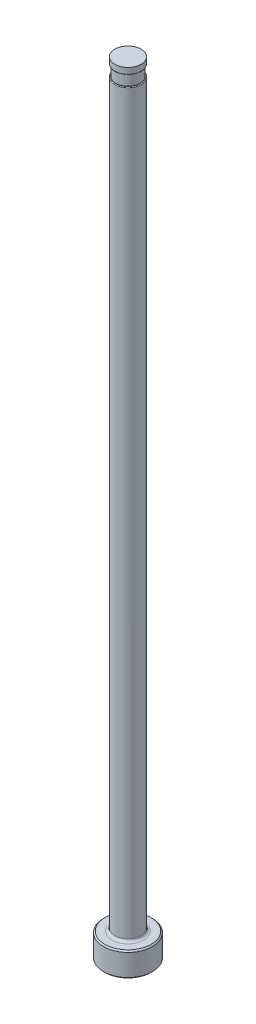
ISO-10303-21;
HEADER;
FILE_DESCRIPTION(('STEP AP214'),'2;1');
FILE_NAME('part.step','',(''),(''),'','','');
FILE_SCHEMA(('AUTOMOTIVE_DESIGN { 1 0 10303 214 1 1 1 1 }'));
ENDSEC;
DATA;
#1=APPLICATION_CONTEXT('core data for automotive mechanical design processes');
#2=APPLICATION_PROTOCOL_DEFINITION('international standard','automotive_design',2000,#1);
#3=PRODUCT_CONTEXT('',#1,'mechanical');
#4=PRODUCT('Part','Part','',(#3));
#5=PRODUCT_RELATED_PRODUCT_CATEGORY('part','',(#4));
#6=PRODUCT_DEFINITION_FORMATION('','',#4);
#7=PRODUCT_DEFINITION_CONTEXT('part definition',#1,'design');
#8=PRODUCT_DEFINITION('design','',#6,#7);
#9=PRODUCT_DEFINITION_SHAPE('','',#8);
#10=(LENGTH_UNIT() NAMED_UNIT(*) SI_UNIT(.MILLI.,.METRE.));
#11=(NAMED_UNIT(*) PLANE_ANGLE_UNIT() SI_UNIT($,.RADIAN.));
#12=(NAMED_UNIT(*) SI_UNIT($,.STERADIAN.) SOLID_ANGLE_UNIT());
#13=UNCERTAINTY_MEASURE_WITH_UNIT(LENGTH_MEASURE(1.E-05),#10,'distance_accuracy_value','');
#14=(GEOMETRIC_REPRESENTATION_CONTEXT(3) GLOBAL_UNCERTAINTY_ASSIGNED_CONTEXT((#13)) GLOBAL_UNIT_ASSIGNED_CONTEXT((#10,
#11,#12)) REPRESENTATION_CONTEXT('',''));
#15=CARTESIAN_POINT('',(0.,0.,0.));
#16=DIRECTION('',(0.,0.,1.));
#17=DIRECTION('',(1.,0.,0.));
#18=AXIS2_PLACEMENT_3D('',#15,#16,#17);
#19=CARTESIAN_POINT('',(-2.57936999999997,151.13,0.));
#20=DIRECTION('',(0.,1.,0.));
#21=DIRECTION('',(0.,0.,1.));
#22=AXIS2_PLACEMENT_3D('',#19,#20,#21);
#23=PLANE('',#22);
#24=CARTESIAN_POINT('',(0.,151.13,0.));
#25=DIRECTION('',(0.,1.,0.));
#26=DIRECTION('',(0.,0.,1.));
#27=AXIS2_PLACEMENT_3D('',#24,#25,#26);
#28=CIRCLE('',#27,2.43331999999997);
#29=CARTESIAN_POINT('',(0.,151.13,2.43331999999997));
#30=VERTEX_POINT('',#29);
#31=EDGE_CURVE('E11',#30,#30,#28,.F.);
#32=ORIENTED_EDGE('',*,*,#31,.T.);
#33=EDGE_LOOP('',(#32));
#34=FACE_BOUND('',#33,.T.);
#35=CARTESIAN_POINT('',(0.,151.13,0.));
#36=DIRECTION('',(0.,1.,0.));
#37=DIRECTION('',(0.,0.,1.));
#38=AXIS2_PLACEMENT_3D('',#35,#36,#37);
#39=CIRCLE('',#38,2.37616999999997);
#40=CARTESIAN_POINT('',(0.,151.13,2.37616999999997));
#41=VERTEX_POINT('',#40);
#42=EDGE_CURVE('E78',#41,#41,#39,.T.);
#43=ORIENTED_EDGE('',*,*,#42,.T.);
#44=EDGE_LOOP('',(#43));
#45=FACE_BOUND('',#44,.T.);
#46=ADVANCED_FACE('F36',(#34,#45),#23,.F.);
#47=CARTESIAN_POINT('',(0.,259.958771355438,0.));
#48=DIRECTION('',(0.,1.,0.));
#49=DIRECTION('',(0.,0.,1.));
#50=AXIS2_PLACEMENT_3D('',#47,#48,#49);
#51=CYLINDRICAL_SURFACE('',#50,2.57936999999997);
#52=DIRECTION('',(0.,1.,0.));
#53=VECTOR('',#52,1.);
#54=CARTESIAN_POINT('',(-2.37616999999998,259.958771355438,-1.00347681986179));
#55=LINE('',#54,#53);
#56=CARTESIAN_POINT('',(-2.37616999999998,148.971,-1.00347681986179));
#57=VERTEX_POINT('',#56);
#58=CARTESIAN_POINT('',(-2.37616999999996,86.614,-1.00347681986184));
#59=VERTEX_POINT('',#58);
#60=EDGE_CURVE('E73',#57,#59,#55,.F.);
#61=ORIENTED_EDGE('',*,*,#60,.F.);
#62=CARTESIAN_POINT('',(0.,148.971,0.));
#63=DIRECTION('',(0.,-1.,0.));
#64=DIRECTION('',(0.,0.,-1.));
#65=AXIS2_PLACEMENT_3D('',#62,#63,#64);
#66=CIRCLE('',#65,2.57936999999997);
#67=CARTESIAN_POINT('',(-2.37616999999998,148.971,1.00347681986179));
#68=VERTEX_POINT('',#67);
#69=EDGE_CURVE('E51',#57,#68,#66,.T.);
#70=ORIENTED_EDGE('',*,*,#69,.T.);
#71=DIRECTION('',(0.,1.,0.));
#72=VECTOR('',#71,1.);
#73=CARTESIAN_POINT('',(-2.37616999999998,259.958771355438,1.00347681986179));
#74=LINE('',#73,#72);
#75=CARTESIAN_POINT('',(-2.37616999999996,86.614,1.00347681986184));
#76=VERTEX_POINT('',#75);
#77=EDGE_CURVE('E84',#76,#68,#74,.T.);
#78=ORIENTED_EDGE('',*,*,#77,.F.);
#79=CARTESIAN_POINT('',(-2.37616999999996,86.614,-1.00347681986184));
#80=CARTESIAN_POINT('',(-2.3761678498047,86.5806535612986,-1.00347324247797));
#81=CARTESIAN_POINT('',(-2.37669600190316,86.547321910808,-1.00223238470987));
#82=CARTESIAN_POINT('',(-2.37878830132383,86.4808712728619,-0.997259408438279));
#83=CARTESIAN_POINT('',(-2.3803526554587,86.4477523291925,-0.993526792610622));
#84=CARTESIAN_POINT('',(-2.38657174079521,86.348866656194,-0.97854537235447));
#85=CARTESIAN_POINT('',(-2.39275229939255,86.2837173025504,-0.963512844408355));
#86=CARTESIAN_POINT('',(-2.40858326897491,86.1569814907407,-0.923223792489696));
#87=CARTESIAN_POINT('',(-2.41823988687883,86.0954016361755,-0.897948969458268));
#88=CARTESIAN_POINT('',(-2.4399460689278,85.9780247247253,-0.837167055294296));
#89=CARTESIAN_POINT('',(-2.45199238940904,85.9222199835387,-0.801673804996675));
#90=CARTESIAN_POINT('',(-2.47634550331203,85.8211237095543,-0.722822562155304));
#91=CARTESIAN_POINT('',(-2.48860868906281,85.7754444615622,-0.679950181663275));
#92=CARTESIAN_POINT('',(-2.51236371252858,85.6930631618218,-0.586096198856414));
#93=CARTESIAN_POINT('',(-2.52385591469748,85.6563568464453,-0.53511846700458));
#94=CARTESIAN_POINT('',(-2.54336333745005,85.5968448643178,-0.432311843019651));
#95=CARTESIAN_POINT('',(-2.55161740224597,85.5729816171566,-0.381139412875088));
#96=CARTESIAN_POINT('',(-2.56521925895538,85.5345821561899,-0.275047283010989));
#97=CARTESIAN_POINT('',(-2.5705685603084,85.5200410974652,-0.220129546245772));
#98=CARTESIAN_POINT('',(-2.57742936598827,85.5015339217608,-0.112636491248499));
#99=CARTESIAN_POINT('',(-2.57920175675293,85.4968477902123,-0.0602005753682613));
#100=CARTESIAN_POINT('',(-2.57951508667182,85.496013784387,0.0447435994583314));
#101=CARTESIAN_POINT('',(-2.57805674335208,85.4998640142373,0.0972518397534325));
#102=CARTESIAN_POINT('',(-2.57214487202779,85.515773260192,0.199435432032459));
#103=CARTESIAN_POINT('',(-2.56776943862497,85.5276183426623,0.249148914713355));
#104=CARTESIAN_POINT('',(-2.55654798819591,85.5589461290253,0.345804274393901));
#105=CARTESIAN_POINT('',(-2.54970197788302,85.5784288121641,0.392746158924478));
#106=CARTESIAN_POINT('',(-2.53407309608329,85.62487953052,0.483513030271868));
#107=CARTESIAN_POINT('',(-2.52525719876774,85.6519775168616,0.527265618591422));
#108=CARTESIAN_POINT('',(-2.5066235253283,85.7126856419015,0.609736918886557));
#109=CARTESIAN_POINT('',(-2.49680555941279,85.7462970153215,0.648454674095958));
#110=CARTESIAN_POINT('',(-2.47647062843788,85.8212568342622,0.722358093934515));
#111=CARTESIAN_POINT('',(-2.46594700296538,85.8629479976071,0.757193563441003));
#112=CARTESIAN_POINT('',(-2.44575759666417,85.951357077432,0.820068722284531));
#113=CARTESIAN_POINT('',(-2.43609222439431,85.9980773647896,0.848105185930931));
#114=CARTESIAN_POINT('',(-2.41760539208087,86.0998831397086,0.899528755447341));
#115=CARTESIAN_POINT('',(-2.40894797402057,86.1553422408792,0.922233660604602));
#116=CARTESIAN_POINT('',(-2.39441308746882,86.269312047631,0.959340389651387));
#117=CARTESIAN_POINT('',(-2.3885356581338,86.3278227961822,0.973742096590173));
#118=CARTESIAN_POINT('',(-2.38160417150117,86.4245543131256,0.990534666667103));
#119=CARTESIAN_POINT('',(-2.37957064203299,86.4622987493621,0.995396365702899));
#120=CARTESIAN_POINT('',(-2.37685226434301,86.5380255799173,1.00186164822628));
#121=CARTESIAN_POINT('',(-2.3761642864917,86.5760072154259,1.00347279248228));
#122=CARTESIAN_POINT('',(-2.37616999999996,86.614,1.00347681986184));
#123=B_SPLINE_CURVE_WITH_KNOTS('',3,(#79,#80,#81,#82,#83,#84,#85,#86,#87,#88,#89,#90,#91,#92,
#93,#94,#95,#96,#97,#98,#99,#100,#101,#102,#103,#104,#105,#106,#107,#108,#109,#110,#111,#112,
#113,#114,#115,#116,#117,#118,#119,#120,#121,#122),.UNSPECIFIED.,.F.,.F.,(4,2,2,2,2,2,2,2,2,2,2,
2,2,2,2,2,2,2,2,2,2,4),(0.,0.099982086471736,0.199984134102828,0.400421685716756,
0.601218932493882,0.80174546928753,0.992181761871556,1.18252738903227,1.35280353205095,
1.52299110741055,1.68023815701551,1.83745028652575,1.99061412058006,2.14377753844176,
2.29973239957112,2.45571685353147,2.62103910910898,2.78643964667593,2.96734496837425,
3.14825283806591,3.26243374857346,3.37634876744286),.UNSPECIFIED.);
#124=EDGE_CURVE('E81',#59,#76,#123,.T.);
#125=ORIENTED_EDGE('',*,*,#124,.F.);
#126=EDGE_LOOP('',(#61,#70,#78,#125));
#127=FACE_BOUND('',#126,.T.);
#128=CARTESIAN_POINT('',(0.,5.25779999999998,0.));
#129=DIRECTION('',(0.,1.,0.));
#130=DIRECTION('',(0.,0.,1.));
#131=AXIS2_PLACEMENT_3D('',#128,#129,#130);
#132=CIRCLE('',#131,2.57936999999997);
#133=CARTESIAN_POINT('',(0.,5.25779999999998,2.57936999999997));
#134=VERTEX_POINT('',#133);
#135=EDGE_CURVE('E116',#134,#134,#132,.T.);
#136=ORIENTED_EDGE('',*,*,#135,.T.);
#137=EDGE_LOOP('',(#136));
#138=FACE_BOUND('',#137,.T.);
#139=ADVANCED_FACE('F82',(#127,#138),#51,.T.);
#140=CARTESIAN_POINT('',(0.,0.,0.));
#141=DIRECTION('',(0.,-1.,0.));
#142=DIRECTION('',(0.,0.,-1.));
#143=AXIS2_PLACEMENT_3D('',#140,#141,#142);
#144=PLANE('',#143);
#145=CARTESIAN_POINT('',(0.,0.,0.));
#146=DIRECTION('',(0.,-1.,0.));
#147=DIRECTION('',(0.,0.,-1.));
#148=AXIS2_PLACEMENT_3D('',#145,#146,#147);
#149=CIRCLE('',#148,4.50849999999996);
#150=CARTESIAN_POINT('',(0.,0.,-4.50849999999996));
#151=VERTEX_POINT('',#150);
#152=EDGE_CURVE('E113',#151,#151,#149,.T.);
#153=ORIENTED_EDGE('',*,*,#152,.T.);
#154=EDGE_LOOP('',(#153));
#155=FACE_BOUND('',#154,.T.);
#156=ADVANCED_FACE('F192',(#155),#144,.T.);
#157=CARTESIAN_POINT('',(0.,259.958771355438,0.));
#158=DIRECTION('',(0.,1.,0.));
#159=DIRECTION('',(0.,0.,1.));
#160=AXIS2_PLACEMENT_3D('',#157,#158,#159);
#161=CYLINDRICAL_SURFACE('',#160,4.76249999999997);
#162=CARTESIAN_POINT('',(0.,4.49579999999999,0.));
#163=DIRECTION('',(0.,1.,0.));
#164=DIRECTION('',(0.,0.,1.));
#165=AXIS2_PLACEMENT_3D('',#162,#163,#164);
#166=CIRCLE('',#165,4.76249999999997);
#167=CARTESIAN_POINT('',(0.,4.49579999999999,4.76249999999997));
#168=VERTEX_POINT('',#167);
#169=EDGE_CURVE('E110',#168,#168,#166,.F.);
#170=ORIENTED_EDGE('',*,*,#169,.T.);
#171=EDGE_LOOP('',(#170));
#172=FACE_BOUND('',#171,.T.);
#173=CARTESIAN_POINT('',(0.,0.254000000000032,0.));
#174=DIRECTION('',(0.,-1.,0.));
#175=DIRECTION('',(0.,0.,-1.));
#176=AXIS2_PLACEMENT_3D('',#173,#174,#175);
#177=CIRCLE('',#176,4.76249999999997);
#178=CARTESIAN_POINT('',(0.,0.254000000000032,-4.76249999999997));
#179=VERTEX_POINT('',#178);
#180=EDGE_CURVE('E107',#179,#179,#177,.F.);
#181=ORIENTED_EDGE('',*,*,#180,.T.);
#182=EDGE_LOOP('',(#181));
#183=FACE_BOUND('',#182,.T.);
#184=ADVANCED_FACE('F195',(#172,#183),#161,.T.);
#185=CARTESIAN_POINT('',(-4.76249999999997,4.7498,0.));
#186=DIRECTION('',(0.,1.,0.));
#187=DIRECTION('',(0.,0.,1.));
#188=AXIS2_PLACEMENT_3D('',#185,#186,#187);
#189=PLANE('',#188);
#190=CARTESIAN_POINT('',(0.,4.7498,0.));
#191=DIRECTION('',(0.,1.,0.));
#192=DIRECTION('',(0.,0.,1.));
#193=AXIS2_PLACEMENT_3D('',#190,#191,#192);
#194=CIRCLE('',#193,3.08736999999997);
#195=CARTESIAN_POINT('',(0.,4.7498,3.08736999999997));
#196=VERTEX_POINT('',#195);
#197=EDGE_CURVE('E87',#196,#196,#194,.F.);
#198=ORIENTED_EDGE('',*,*,#197,.T.);
#199=EDGE_LOOP('',(#198));
#200=FACE_BOUND('',#199,.T.);
#201=CARTESIAN_POINT('',(0.,4.7498,0.));
#202=DIRECTION('',(0.,1.,0.));
#203=DIRECTION('',(0.,0.,1.));
#204=AXIS2_PLACEMENT_3D('',#201,#202,#203);
#205=CIRCLE('',#204,4.50849999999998);
#206=CARTESIAN_POINT('',(0.,4.7498,4.50849999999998));
#207=VERTEX_POINT('',#206);
#208=EDGE_CURVE('E104',#207,#207,#205,.T.);
#209=ORIENTED_EDGE('',*,*,#208,.T.);
#210=EDGE_LOOP('',(#209));
#211=FACE_BOUND('',#210,.T.);
#212=ADVANCED_FACE('F190',(#200,#211),#189,.T.);
#213=CARTESIAN_POINT('',(0.,4.74980000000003,0.));
#214=DIRECTION('',(0.,-1.,0.));
#215=DIRECTION('',(0.,0.,-1.));
#216=AXIS2_PLACEMENT_3D('',#213,#214,#215);
#217=CONICAL_SURFACE('',#216,4.50849999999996,0.785398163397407);
#218=ORIENTED_EDGE('',*,*,#169,.F.);
#219=EDGE_LOOP('',(#218));
#220=FACE_BOUND('',#219,.T.);
#221=ORIENTED_EDGE('',*,*,#208,.F.);
#222=EDGE_LOOP('',(#221));
#223=FACE_BOUND('',#222,.T.);
#224=ADVANCED_FACE('F186',(#220,#223),#217,.T.);
#225=CARTESIAN_POINT('',(0.,0.254000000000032,0.));
#226=DIRECTION('',(0.,1.,0.));
#227=DIRECTION('',(0.,0.,1.));
#228=AXIS2_PLACEMENT_3D('',#225,#226,#227);
#229=CONICAL_SURFACE('',#228,4.76249999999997,0.785398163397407);
#230=ORIENTED_EDGE('',*,*,#152,.F.);
#231=EDGE_LOOP('',(#230));
#232=FACE_BOUND('',#231,.T.);
#233=ORIENTED_EDGE('',*,*,#180,.F.);
#234=EDGE_LOOP('',(#233));
#235=FACE_BOUND('',#234,.T.);
#236=ADVANCED_FACE('F182',(#232,#235),#229,.T.);
#237=CARTESIAN_POINT('',(0.,5.25779999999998,0.));
#238=DIRECTION('',(0.,1.,0.));
#239=DIRECTION('',(0.,0.,1.));
#240=AXIS2_PLACEMENT_3D('',#237,#238,#239);
#241=TOROIDAL_SURFACE('',#240,3.08736999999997,0.508);
#242=ORIENTED_EDGE('',*,*,#197,.F.);
#243=EDGE_LOOP('',(#242));
#244=FACE_BOUND('',#243,.T.);
#245=ORIENTED_EDGE('',*,*,#135,.F.);
#246=EDGE_LOOP('',(#245));
#247=FACE_BOUND('',#246,.T.);
#248=ADVANCED_FACE('F147',(#244,#247),#241,.F.);
#249=CARTESIAN_POINT('',(-2.57936999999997,149.098,0.));
#250=DIRECTION('',(0.,-1.,0.));
#251=DIRECTION('',(0.,0.,-1.));
#252=AXIS2_PLACEMENT_3D('',#249,#250,#251);
#253=PLANE('',#252);
#254=DIRECTION('',(0.,0.,1.));
#255=VECTOR('',#254,1.);
#256=CARTESIAN_POINT('',(-2.37616999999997,149.098,0.));
#257=LINE('',#256,#255);
#258=CARTESIAN_POINT('',(-2.37616999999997,149.098,0.));
#259=VERTEX_POINT('',#258);
#260=CARTESIAN_POINT('',(-2.37616999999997,149.098,0.60657625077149));
#261=VERTEX_POINT('',#260);
#262=EDGE_CURVE('E90',#259,#261,#257,.T.);
#263=ORIENTED_EDGE('',*,*,#262,.T.);
#264=CARTESIAN_POINT('',(0.,149.098,0.));
#265=DIRECTION('',(0.,-1.,0.));
#266=DIRECTION('',(0.,0.,-1.));
#267=AXIS2_PLACEMENT_3D('',#264,#265,#266);
#268=CIRCLE('',#267,2.45236999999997);
#269=CARTESIAN_POINT('',(-2.37616999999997,149.098,-0.60657625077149));
#270=VERTEX_POINT('',#269);
#271=EDGE_CURVE('E86',#261,#270,#268,.F.);
#272=ORIENTED_EDGE('',*,*,#271,.T.);
#273=EDGE_CURVE('E79',#270,#259,#257,.T.);
#274=ORIENTED_EDGE('',*,*,#273,.T.);
#275=CARTESIAN_POINT('',(0.,149.098,0.));
#276=DIRECTION('',(0.,1.,0.));
#277=DIRECTION('',(0.,0.,1.));
#278=AXIS2_PLACEMENT_3D('',#275,#276,#277);
#279=CIRCLE('',#278,2.37616999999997);
#280=EDGE_CURVE('E101',#259,#259,#279,.T.);
#281=ORIENTED_EDGE('',*,*,#280,.F.);
#282=EDGE_LOOP('',(#263,#272,#274,#281));
#283=FACE_BOUND('',#282,.T.);
#284=ADVANCED_FACE('F144',(#283),#253,.F.);
#285=CARTESIAN_POINT('',(0.,153.448281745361,0.));
#286=DIRECTION('',(0.,1.,0.));
#287=DIRECTION('',(0.,0.,1.));
#288=AXIS2_PLACEMENT_3D('',#285,#286,#287);
#289=CYLINDRICAL_SURFACE('',#288,2.37616999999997);
#290=ORIENTED_EDGE('',*,*,#42,.F.);
#291=EDGE_LOOP('',(#290));
#292=FACE_BOUND('',#291,.T.);
#293=ORIENTED_EDGE('',*,*,#280,.T.);
#294=EDGE_LOOP('',(#293));
#295=FACE_BOUND('',#294,.T.);
#296=ADVANCED_FACE('F141',(#292,#295),#289,.T.);
#297=CARTESIAN_POINT('',(-2.37616999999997,150.114,-4.76249999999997));
#298=DIRECTION('',(1.,0.,0.));
#299=DIRECTION('',(0.,1.,0.));
#300=AXIS2_PLACEMENT_3D('',#297,#298,#299);
#301=PLANE('',#300);
#302=ORIENTED_EDGE('',*,*,#273,.F.);
#303=CARTESIAN_POINT('',(-2.37616999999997,149.098,-0.60657625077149));
#304=CARTESIAN_POINT('',(-2.37616999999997,149.097986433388,-0.627774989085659));
#305=CARTESIAN_POINT('',(-2.37616999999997,149.097673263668,-0.648986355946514));
#306=CARTESIAN_POINT('',(-2.37616999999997,149.096169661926,-0.691484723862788));
#307=CARTESIAN_POINT('',(-2.37616999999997,149.094974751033,-0.712771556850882));
#308=CARTESIAN_POINT('',(-2.37616999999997,149.091417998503,-0.755326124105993));
#309=CARTESIAN_POINT('',(-2.37616999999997,149.089052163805,-0.776593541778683));
#310=CARTESIAN_POINT('',(-2.37616999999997,149.082718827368,-0.818863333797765));
#311=CARTESIAN_POINT('',(-2.37616999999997,149.078755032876,-0.839866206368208));
#312=CARTESIAN_POINT('',(-2.37616999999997,149.071365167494,-0.869601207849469));
#313=CARTESIAN_POINT('',(-2.37616999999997,149.068897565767,-0.878570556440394));
#314=CARTESIAN_POINT('',(-2.37616999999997,149.063395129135,-0.896363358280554));
#315=CARTESIAN_POINT('',(-2.37616999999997,149.060358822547,-0.905186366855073));
#316=CARTESIAN_POINT('',(-2.37616999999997,149.053046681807,-0.923923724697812));
#317=CARTESIAN_POINT('',(-2.37616999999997,149.048651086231,-0.933791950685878));
#318=CARTESIAN_POINT('',(-2.37616999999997,149.038570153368,-0.952838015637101));
#319=CARTESIAN_POINT('',(-2.37616999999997,149.032891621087,-0.962019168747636));
#320=CARTESIAN_POINT('',(-2.37616999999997,149.023665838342,-0.973806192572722));
#321=CARTESIAN_POINT('',(-2.37616999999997,149.020910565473,-0.977026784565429));
#322=CARTESIAN_POINT('',(-2.37616999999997,149.015048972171,-0.983149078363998));
#323=CARTESIAN_POINT('',(-2.37616999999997,149.011942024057,-0.986050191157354));
#324=CARTESIAN_POINT('',(-2.37616999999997,149.005290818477,-0.991423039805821));
#325=CARTESIAN_POINT('',(-2.37616999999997,149.001740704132,-0.993887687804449));
#326=CARTESIAN_POINT('',(-2.37616999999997,148.994248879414,-0.998099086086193));
#327=CARTESIAN_POINT('',(-2.37616999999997,148.9903097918,-0.999850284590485));
#328=CARTESIAN_POINT('',(-2.37616999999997,148.983771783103,-1.00188288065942));
#329=CARTESIAN_POINT('',(-2.37616999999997,148.981268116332,-1.00247204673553));
#330=CARTESIAN_POINT('',(-2.37616999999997,148.976178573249,-1.00327288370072));
#331=CARTESIAN_POINT('',(-2.37616999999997,148.973592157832,-1.00348108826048));
#332=CARTESIAN_POINT('',(-2.37616999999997,148.971,-1.00347681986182));
#333=B_SPLINE_CURVE_WITH_KNOTS('',3,(#303,#304,#305,#306,#307,#308,#309,#310,#311,#312,#313,
#314,#315,#316,#317,#318,#319,#320,#321,#322,#323,#324,#325,#326,#327,#328,#329,#330,#331,#332),
.UNSPECIFIED.,.F.,.F.,(4,2,2,2,2,2,2,2,2,2,2,2,2,2,4),(0.,0.0636141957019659,0.127553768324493,
0.191712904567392,0.255724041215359,0.283618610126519,0.311586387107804,0.343944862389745,
0.376135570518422,0.388831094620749,0.401549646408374,0.414458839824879,0.427286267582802,
0.434975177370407,0.442733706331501),.UNSPECIFIED.);
#334=EDGE_CURVE('E59',#270,#57,#333,.T.);
#335=ORIENTED_EDGE('',*,*,#334,.T.);
#336=ORIENTED_EDGE('',*,*,#60,.T.);
#337=DIRECTION('',(0.,0.,1.));
#338=VECTOR('',#337,1.);
#339=CARTESIAN_POINT('',(-2.37616999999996,86.614,-4.76249999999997));
#340=LINE('',#339,#338);
#341=EDGE_CURVE('E77',#59,#76,#340,.T.);
#342=ORIENTED_EDGE('',*,*,#341,.T.);
#343=ORIENTED_EDGE('',*,*,#77,.T.);
#344=CARTESIAN_POINT('',(-2.37616999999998,148.971,1.00347681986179));
#345=CARTESIAN_POINT('',(-2.37616999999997,148.97408677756,1.00348533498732));
#346=CARTESIAN_POINT('',(-2.37616999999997,148.977162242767,1.00318798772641));
#347=CARTESIAN_POINT('',(-2.37616999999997,148.983176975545,1.00206106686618));
#348=CARTESIAN_POINT('',(-2.37616999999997,148.986117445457,1.00123801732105));
#349=CARTESIAN_POINT('',(-2.37616999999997,148.992507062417,0.998885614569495));
#350=CARTESIAN_POINT('',(-2.37616999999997,148.995910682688,0.997234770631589));
#351=CARTESIAN_POINT('',(-2.37616999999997,149.002418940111,0.993404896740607));
#352=CARTESIAN_POINT('',(-2.37616999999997,149.005521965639,0.991223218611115));
#353=CARTESIAN_POINT('',(-2.37616999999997,149.013245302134,0.985017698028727));
#354=CARTESIAN_POINT('',(-2.37616999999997,149.01761779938,0.980688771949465));
#355=CARTESIAN_POINT('',(-2.37616999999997,149.025686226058,0.971452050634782));
#356=CARTESIAN_POINT('',(-2.37616999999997,149.029380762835,0.966543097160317));
#357=CARTESIAN_POINT('',(-2.37616999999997,149.039861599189,0.950989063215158));
#358=CARTESIAN_POINT('',(-2.37616999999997,149.045783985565,0.939769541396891));
#359=CARTESIAN_POINT('',(-2.37616999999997,149.056142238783,0.916677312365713));
#360=CARTESIAN_POINT('',(-2.37616999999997,149.060573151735,0.904802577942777));
#361=CARTESIAN_POINT('',(-2.37616999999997,149.070828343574,0.873126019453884));
#362=CARTESIAN_POINT('',(-2.37616999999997,149.075772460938,0.853042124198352));
#363=CARTESIAN_POINT('',(-2.37616999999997,149.083834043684,0.812501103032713));
#364=CARTESIAN_POINT('',(-2.37616999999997,149.086947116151,0.792043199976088));
#365=CARTESIAN_POINT('',(-2.37616999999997,149.094347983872,0.730361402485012));
#366=CARTESIAN_POINT('',(-2.37616999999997,149.096678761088,0.688903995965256));
#367=CARTESIAN_POINT('',(-2.37616999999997,149.097717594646,0.640645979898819));
#368=CARTESIAN_POINT('',(-2.37616999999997,149.0978254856,0.633819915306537));
#369=CARTESIAN_POINT('',(-2.37616999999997,149.097967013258,0.620188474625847));
#370=CARTESIAN_POINT('',(-2.37616999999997,149.098000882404,0.613383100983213));
#371=CARTESIAN_POINT('',(-2.37616999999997,149.098,0.606576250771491));
#372=B_SPLINE_CURVE_WITH_KNOTS('',3,(#344,#345,#346,#347,#348,#349,#350,#351,#352,#353,#354,
#355,#356,#357,#358,#359,#360,#361,#362,#363,#364,#365,#366,#367,#368,#369,#370,#371),
.UNSPECIFIED.,.F.,.F.,(4,2,2,2,2,2,2,2,2,2,2,2,2,4),(0.,0.00922779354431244,0.0183432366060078,
0.0296284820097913,0.0409712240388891,0.0593256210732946,0.0777173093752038,0.115565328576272,
0.153537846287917,0.215427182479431,0.277464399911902,0.401767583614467,0.422249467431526,
0.44266694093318),.UNSPECIFIED.);
#373=EDGE_CURVE('E172',#68,#261,#372,.T.);
#374=ORIENTED_EDGE('',*,*,#373,.T.);
#375=ORIENTED_EDGE('',*,*,#262,.F.);
#376=EDGE_LOOP('',(#302,#335,#336,#342,#343,#374,#375));
#377=FACE_BOUND('',#376,.T.);
#378=ADVANCED_FACE('F75',(#377),#301,.F.);
#379=CARTESIAN_POINT('',(-5.55116999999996,86.614,-4.76249999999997));
#380=DIRECTION('',(0.,0.,1.));
#381=DIRECTION('',(1.,0.,0.));
#382=AXIS2_PLACEMENT_3D('',#379,#380,#381);
#383=CYLINDRICAL_SURFACE('',#382,3.175);
#384=ORIENTED_EDGE('',*,*,#341,.F.);
#385=ORIENTED_EDGE('',*,*,#124,.T.);
#386=EDGE_LOOP('',(#384,#385));
#387=FACE_BOUND('',#386,.T.);
#388=ADVANCED_FACE('F89',(#387),#383,.F.);
#389=CARTESIAN_POINT('',(0.,152.687735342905,0.));
#390=DIRECTION('',(0.,1.,0.));
#391=DIRECTION('',(0.,0.,1.));
#392=AXIS2_PLACEMENT_3D('',#389,#390,#391);
#393=CYLINDRICAL_SURFACE('',#392,2.56031999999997);
#394=CARTESIAN_POINT('',(0.,151.257,0.));
#395=DIRECTION('',(0.,1.,0.));
#396=DIRECTION('',(0.,0.,1.));
#397=AXIS2_PLACEMENT_3D('',#394,#395,#396);
#398=CIRCLE('',#397,2.56031999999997);
#399=CARTESIAN_POINT('',(0.,151.257,2.56031999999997));
#400=VERTEX_POINT('',#399);
#401=EDGE_CURVE('E44',#400,#400,#398,.T.);
#402=ORIENTED_EDGE('',*,*,#401,.T.);
#403=EDGE_LOOP('',(#402));
#404=FACE_BOUND('',#403,.T.);
#405=CARTESIAN_POINT('',(0.,152.4,0.));
#406=DIRECTION('',(0.,1.,0.));
#407=DIRECTION('',(0.,0.,1.));
#408=AXIS2_PLACEMENT_3D('',#405,#406,#407);
#409=CIRCLE('',#408,2.56031999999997);
#410=CARTESIAN_POINT('',(0.,152.4,2.56031999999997));
#411=VERTEX_POINT('',#410);
#412=EDGE_CURVE('E91',#411,#411,#409,.T.);
#413=ORIENTED_EDGE('',*,*,#412,.F.);
#414=EDGE_LOOP('',(#413));
#415=FACE_BOUND('',#414,.T.);
#416=ADVANCED_FACE('F135',(#404,#415),#393,.T.);
#417=CARTESIAN_POINT('',(-2.57936999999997,152.4,0.));
#418=DIRECTION('',(0.,1.,0.));
#419=DIRECTION('',(0.,0.,1.));
#420=AXIS2_PLACEMENT_3D('',#417,#418,#419);
#421=PLANE('',#420);
#422=ORIENTED_EDGE('',*,*,#412,.T.);
#423=EDGE_LOOP('',(#422));
#424=FACE_BOUND('',#423,.T.);
#425=ADVANCED_FACE('F149',(#424),#421,.T.);
#426=CARTESIAN_POINT('',(0.,148.971,0.));
#427=DIRECTION('',(0.,-1.,0.));
#428=DIRECTION('',(0.,0.,-1.));
#429=AXIS2_PLACEMENT_3D('',#426,#427,#428);
#430=TOROIDAL_SURFACE('',#429,2.45236999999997,0.127);
#431=ORIENTED_EDGE('',*,*,#373,.F.);
#432=ORIENTED_EDGE('',*,*,#69,.F.);
#433=ORIENTED_EDGE('',*,*,#334,.F.);
#434=ORIENTED_EDGE('',*,*,#271,.F.);
#435=EDGE_LOOP('',(#431,#432,#433,#434));
#436=FACE_BOUND('',#435,.T.);
#437=ADVANCED_FACE('F151',(#436),#430,.T.);
#438=CARTESIAN_POINT('',(0.,151.257,0.));
#439=DIRECTION('',(0.,1.,0.));
#440=DIRECTION('',(0.,0.,1.));
#441=AXIS2_PLACEMENT_3D('',#438,#439,#440);
#442=TOROIDAL_SURFACE('',#441,2.43331999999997,0.127);
#443=ORIENTED_EDGE('',*,*,#31,.F.);
#444=EDGE_LOOP('',(#443));
#445=FACE_BOUND('',#444,.T.);
#446=ORIENTED_EDGE('',*,*,#401,.F.);
#447=EDGE_LOOP('',(#446));
#448=FACE_BOUND('',#447,.T.);
#449=ADVANCED_FACE('F38',(#445,#448),#442,.T.);
#450=CLOSED_SHELL('',(#46,#139,#156,#184,#212,#224,#236,#248,#284,#296,#378,#388,#416,#425,#437,#449));
#451=MANIFOLD_SOLID_BREP('B2',#450);
#452=ADVANCED_BREP_SHAPE_REPRESENTATION('',(#18,#451),#14);
#453=SHAPE_DEFINITION_REPRESENTATION(#9,#452);
ENDSEC;
END-ISO-10303-21;
